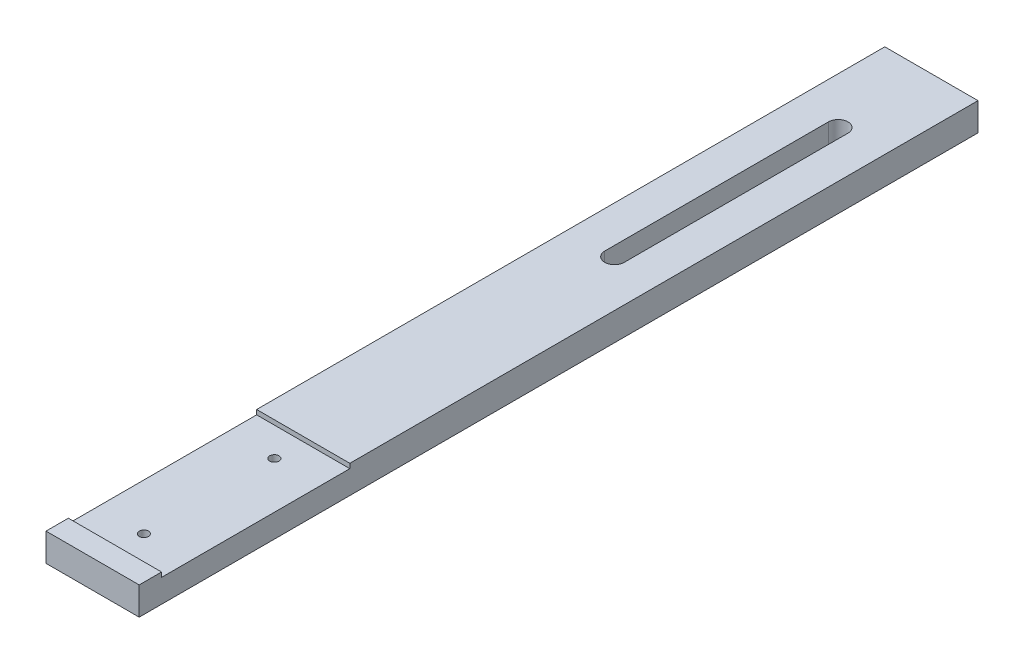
from build123d import *

# Parameters (mm, degrees)
ESQUISSE1_W             = 50
ESQUISSE1_H             = 15
EXTRUSION1_DEPTH        = 450
TROU_TARAUD_M61_D       = 5
ENL_V_MAT_EXTRU_1_DEPTH = 454.0176597
ENL_V_MAT_EXTRU_2_REACH = 455.018
ESQUISSE5_W             = 101
ESQUISSE5_H             = 2.5


with BuildPart() as part:
    # Esquisse1 → Extrusion1 (new body)
    with BuildSketch(Plane.XY):
        with Locations((25, 7.5)):
            Rectangle(ESQUISSE1_W, ESQUISSE1_H)
    extrude(amount=EXTRUSION1_DEPTH)

    # Trou taraud_ M61 (through all)
    with Locations(Plane(origin=(0, 15, 0), x_dir=(-1, 0, 0), z_dir=(0, 1, 0))):
        with Locations((-25, 352.5), (-25, 422.5)):
            Hole(TROU_TARAUD_M61_D / 2)

    # Esquisse4 → Enl_v. mat.-Extru.1 (cut, through all)
    with BuildSketch(Plane(origin=(0, 15, 0), x_dir=(-1, 0, 0), z_dir=(0, 1, 0))):
        with BuildLine():
            Line((-30.25, 170), (-30.25, 50))
            ThreePointArc((-30.25, 50), (-25, 44.75), (-19.75, 50))
            Line((-19.75, 50), (-19.75, 170))
            ThreePointArc((-19.75, 170), (-25, 175.25), (-30.25, 170))
        make_face()
    extrude(amount=-ENL_V_MAT_EXTRU_1_DEPTH, mode=Mode.SUBTRACT)

    # Esquisse5 → Enl_v. mat.-Extru.2 (cut, up to next)
    with BuildSketch(Plane(origin=(50, 0, 0), x_dir=(0, 0, -1), z_dir=(1, 0, 0)), mode=Mode.PRIVATE) as enl_v_mat_extru_2_sk1:
        with Locations((-387.5, 13.75)):
            Rectangle(ESQUISSE5_W, ESQUISSE5_H)
    enl_v_mat_extru_2_tool1 = extrude(enl_v_mat_extru_2_sk1.sketch, amount=-ENL_V_MAT_EXTRU_2_REACH, mode=Mode.PRIVATE) & part.part
    add(enl_v_mat_extru_2_tool1.solids().sort_by_distance((50, 13.75, 387.5))[0], mode=Mode.SUBTRACT)


solid = part.part
